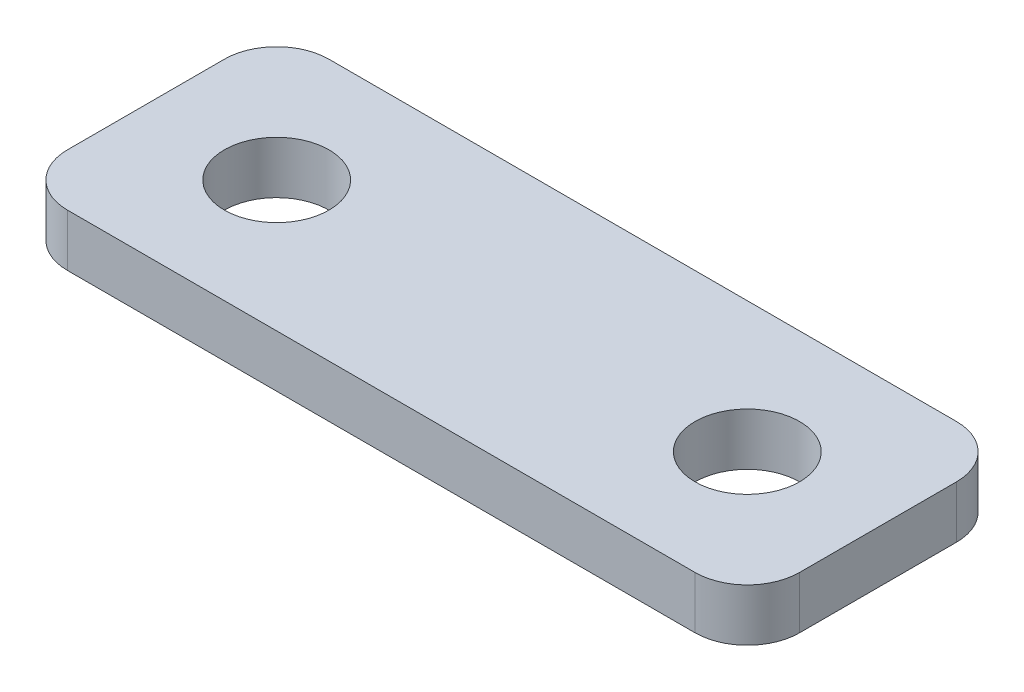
ISO-10303-21;
HEADER;
FILE_DESCRIPTION(('STEP AP214'),'2;1');
FILE_NAME('part.step','',(''),(''),'','','');
FILE_SCHEMA(('AUTOMOTIVE_DESIGN { 1 0 10303 214 1 1 1 1 }'));
ENDSEC;
DATA;
#1=APPLICATION_CONTEXT('core data for automotive mechanical design processes');
#2=APPLICATION_PROTOCOL_DEFINITION('international standard','automotive_design',2000,#1);
#3=PRODUCT_CONTEXT('',#1,'mechanical');
#4=PRODUCT('Part','Part','',(#3));
#5=PRODUCT_RELATED_PRODUCT_CATEGORY('part','',(#4));
#6=PRODUCT_DEFINITION_FORMATION('','',#4);
#7=PRODUCT_DEFINITION_CONTEXT('part definition',#1,'design');
#8=PRODUCT_DEFINITION('design','',#6,#7);
#9=PRODUCT_DEFINITION_SHAPE('','',#8);
#10=(LENGTH_UNIT() NAMED_UNIT(*) SI_UNIT(.MILLI.,.METRE.));
#11=(NAMED_UNIT(*) PLANE_ANGLE_UNIT() SI_UNIT($,.RADIAN.));
#12=(NAMED_UNIT(*) SI_UNIT($,.STERADIAN.) SOLID_ANGLE_UNIT());
#13=UNCERTAINTY_MEASURE_WITH_UNIT(LENGTH_MEASURE(1.E-05),#10,'distance_accuracy_value','');
#14=(GEOMETRIC_REPRESENTATION_CONTEXT(3) GLOBAL_UNCERTAINTY_ASSIGNED_CONTEXT((#13)) GLOBAL_UNIT_ASSIGNED_CONTEXT((#10,
#11,#12)) REPRESENTATION_CONTEXT('',''));
#15=CARTESIAN_POINT('',(0.,0.,0.));
#16=DIRECTION('',(0.,0.,1.));
#17=DIRECTION('',(1.,0.,0.));
#18=AXIS2_PLACEMENT_3D('',#15,#16,#17);
#19=CARTESIAN_POINT('',(-19.05,3.175,4.7625));
#20=DIRECTION('',(0.,1.,0.));
#21=DIRECTION('',(0.,0.,1.));
#22=AXIS2_PLACEMENT_3D('',#19,#20,#21);
#23=PLANE('',#22);
#24=CARTESIAN_POINT('',(-14.2875,3.175,0.));
#25=DIRECTION('',(0.,1.,0.));
#26=DIRECTION('',(0.,0.,1.));
#27=AXIS2_PLACEMENT_3D('',#24,#25,#26);
#28=CIRCLE('',#27,3.175);
#29=CARTESIAN_POINT('',(-14.2875,3.175,3.175));
#30=VERTEX_POINT('',#29);
#31=EDGE_CURVE('E152',#30,#30,#28,.T.);
#32=ORIENTED_EDGE('',*,*,#31,.F.);
#33=EDGE_LOOP('',(#32));
#34=FACE_BOUND('',#33,.T.);
#35=CARTESIAN_POINT('',(-19.05,3.175,4.7625));
#36=DIRECTION('',(0.,1.,0.));
#37=DIRECTION('',(0.,0.,1.));
#38=AXIS2_PLACEMENT_3D('',#35,#36,#37);
#39=CIRCLE('',#38,3.175);
#40=CARTESIAN_POINT('',(-22.225,3.175,4.76249999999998));
#41=VERTEX_POINT('',#40);
#42=CARTESIAN_POINT('',(-19.05,3.175,7.9375));
#43=VERTEX_POINT('',#42);
#44=EDGE_CURVE('E170',#41,#43,#39,.T.);
#45=ORIENTED_EDGE('',*,*,#44,.T.);
#46=DIRECTION('',(1.,0.,0.));
#47=VECTOR('',#46,1.);
#48=CARTESIAN_POINT('',(-19.05,3.175,7.9375));
#49=LINE('',#48,#47);
#50=CARTESIAN_POINT('',(19.05,3.175,7.9375));
#51=VERTEX_POINT('',#50);
#52=EDGE_CURVE('E106',#43,#51,#49,.T.);
#53=ORIENTED_EDGE('',*,*,#52,.T.);
#54=CARTESIAN_POINT('',(19.05,3.175,4.7625));
#55=DIRECTION('',(0.,1.,0.));
#56=DIRECTION('',(0.,0.,1.));
#57=AXIS2_PLACEMENT_3D('',#54,#55,#56);
#58=CIRCLE('',#57,3.175);
#59=CARTESIAN_POINT('',(22.225,3.175,4.76249999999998));
#60=VERTEX_POINT('',#59);
#61=EDGE_CURVE('E191',#51,#60,#58,.T.);
#62=ORIENTED_EDGE('',*,*,#61,.T.);
#63=DIRECTION('',(0.,0.,-1.));
#64=VECTOR('',#63,1.);
#65=CARTESIAN_POINT('',(22.225,3.175,-4.76249999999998));
#66=LINE('',#65,#64);
#67=CARTESIAN_POINT('',(22.225,3.175,-4.76249999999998));
#68=VERTEX_POINT('',#67);
#69=EDGE_CURVE('E205',#60,#68,#66,.T.);
#70=ORIENTED_EDGE('',*,*,#69,.T.);
#71=CARTESIAN_POINT('',(19.05,3.175,-4.7625));
#72=DIRECTION('',(0.,1.,0.));
#73=DIRECTION('',(0.,0.,-1.));
#74=AXIS2_PLACEMENT_3D('',#71,#72,#73);
#75=CIRCLE('',#74,3.175);
#76=CARTESIAN_POINT('',(19.05,3.175,-7.9375));
#77=VERTEX_POINT('',#76);
#78=EDGE_CURVE('E125',#68,#77,#75,.T.);
#79=ORIENTED_EDGE('',*,*,#78,.T.);
#80=DIRECTION('',(-1.,0.,0.));
#81=VECTOR('',#80,1.);
#82=CARTESIAN_POINT('',(-19.05,3.175,-7.9375));
#83=LINE('',#82,#81);
#84=CARTESIAN_POINT('',(-19.05,3.175,-7.9375));
#85=VERTEX_POINT('',#84);
#86=EDGE_CURVE('E119',#77,#85,#83,.T.);
#87=ORIENTED_EDGE('',*,*,#86,.T.);
#88=CARTESIAN_POINT('',(-19.05,3.175,-4.7625));
#89=DIRECTION('',(0.,1.,0.));
#90=DIRECTION('',(0.,0.,1.));
#91=AXIS2_PLACEMENT_3D('',#88,#89,#90);
#92=CIRCLE('',#91,3.175);
#93=CARTESIAN_POINT('',(-22.225,3.175,-4.76249999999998));
#94=VERTEX_POINT('',#93);
#95=EDGE_CURVE('E123',#85,#94,#92,.T.);
#96=ORIENTED_EDGE('',*,*,#95,.T.);
#97=DIRECTION('',(0.,0.,1.));
#98=VECTOR('',#97,1.);
#99=CARTESIAN_POINT('',(-22.225,3.175,-4.76249999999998));
#100=LINE('',#99,#98);
#101=EDGE_CURVE('E63',#94,#41,#100,.T.);
#102=ORIENTED_EDGE('',*,*,#101,.T.);
#103=EDGE_LOOP('',(#45,#53,#62,#70,#79,#87,#96,#102));
#104=FACE_BOUND('',#103,.T.);
#105=CARTESIAN_POINT('',(14.2875,3.175,0.));
#106=DIRECTION('',(0.,1.,0.));
#107=DIRECTION('',(0.,0.,1.));
#108=AXIS2_PLACEMENT_3D('',#105,#106,#107);
#109=CIRCLE('',#108,3.175);
#110=CARTESIAN_POINT('',(14.2875,3.175,3.175));
#111=VERTEX_POINT('',#110);
#112=EDGE_CURVE('E219',#111,#111,#109,.T.);
#113=ORIENTED_EDGE('',*,*,#112,.F.);
#114=EDGE_LOOP('',(#113));
#115=FACE_BOUND('',#114,.T.);
#116=ADVANCED_FACE('F45',(#34,#104,#115),#23,.T.);
#117=CARTESIAN_POINT('',(-19.05,0.,4.7625));
#118=DIRECTION('',(0.,1.,0.));
#119=DIRECTION('',(0.,0.,1.));
#120=AXIS2_PLACEMENT_3D('',#117,#118,#119);
#121=PLANE('',#120);
#122=CARTESIAN_POINT('',(-19.05,0.,4.7625));
#123=DIRECTION('',(0.,1.,0.));
#124=DIRECTION('',(0.,0.,1.));
#125=AXIS2_PLACEMENT_3D('',#122,#123,#124);
#126=CIRCLE('',#125,3.175);
#127=CARTESIAN_POINT('',(-22.225,0.,4.76249999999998));
#128=VERTEX_POINT('',#127);
#129=CARTESIAN_POINT('',(-19.05,0.,7.9375));
#130=VERTEX_POINT('',#129);
#131=EDGE_CURVE('E147',#128,#130,#126,.T.);
#132=ORIENTED_EDGE('',*,*,#131,.F.);
#133=DIRECTION('',(0.,0.,1.));
#134=VECTOR('',#133,1.);
#135=CARTESIAN_POINT('',(-22.225,0.,-4.76249999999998));
#136=LINE('',#135,#134);
#137=CARTESIAN_POINT('',(-22.225,0.,-4.76249999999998));
#138=VERTEX_POINT('',#137);
#139=EDGE_CURVE('E98',#138,#128,#136,.T.);
#140=ORIENTED_EDGE('',*,*,#139,.F.);
#141=CARTESIAN_POINT('',(-19.05,0.,-4.7625));
#142=DIRECTION('',(0.,1.,0.));
#143=DIRECTION('',(0.,0.,1.));
#144=AXIS2_PLACEMENT_3D('',#141,#142,#143);
#145=CIRCLE('',#144,3.175);
#146=CARTESIAN_POINT('',(-19.05,0.,-7.9375));
#147=VERTEX_POINT('',#146);
#148=EDGE_CURVE('E92',#147,#138,#145,.T.);
#149=ORIENTED_EDGE('',*,*,#148,.F.);
#150=DIRECTION('',(-1.,0.,0.));
#151=VECTOR('',#150,1.);
#152=CARTESIAN_POINT('',(-19.05,0.,-7.9375));
#153=LINE('',#152,#151);
#154=CARTESIAN_POINT('',(19.05,0.,-7.9375));
#155=VERTEX_POINT('',#154);
#156=EDGE_CURVE('E134',#155,#147,#153,.T.);
#157=ORIENTED_EDGE('',*,*,#156,.F.);
#158=CARTESIAN_POINT('',(19.05,0.,-4.7625));
#159=DIRECTION('',(0.,1.,0.));
#160=DIRECTION('',(0.,0.,-1.));
#161=AXIS2_PLACEMENT_3D('',#158,#159,#160);
#162=CIRCLE('',#161,3.175);
#163=CARTESIAN_POINT('',(22.225,0.,-4.76249999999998));
#164=VERTEX_POINT('',#163);
#165=EDGE_CURVE('E161',#164,#155,#162,.T.);
#166=ORIENTED_EDGE('',*,*,#165,.F.);
#167=DIRECTION('',(0.,0.,-1.));
#168=VECTOR('',#167,1.);
#169=CARTESIAN_POINT('',(22.225,0.,-4.76249999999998));
#170=LINE('',#169,#168);
#171=CARTESIAN_POINT('',(22.225,0.,4.76249999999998));
#172=VERTEX_POINT('',#171);
#173=EDGE_CURVE('E158',#172,#164,#170,.T.);
#174=ORIENTED_EDGE('',*,*,#173,.F.);
#175=CARTESIAN_POINT('',(19.05,0.,4.7625));
#176=DIRECTION('',(0.,1.,0.));
#177=DIRECTION('',(0.,0.,1.));
#178=AXIS2_PLACEMENT_3D('',#175,#176,#177);
#179=CIRCLE('',#178,3.175);
#180=CARTESIAN_POINT('',(19.05,0.,7.9375));
#181=VERTEX_POINT('',#180);
#182=EDGE_CURVE('E155',#181,#172,#179,.T.);
#183=ORIENTED_EDGE('',*,*,#182,.F.);
#184=DIRECTION('',(1.,0.,0.));
#185=VECTOR('',#184,1.);
#186=CARTESIAN_POINT('',(-19.05,0.,7.9375));
#187=LINE('',#186,#185);
#188=EDGE_CURVE('E151',#130,#181,#187,.T.);
#189=ORIENTED_EDGE('',*,*,#188,.F.);
#190=EDGE_LOOP('',(#132,#140,#149,#157,#166,#174,#183,#189));
#191=FACE_BOUND('',#190,.T.);
#192=CARTESIAN_POINT('',(-14.2875,0.,0.));
#193=DIRECTION('',(0.,1.,0.));
#194=DIRECTION('',(0.,0.,1.));
#195=AXIS2_PLACEMENT_3D('',#192,#193,#194);
#196=CIRCLE('',#195,3.175);
#197=CARTESIAN_POINT('',(-14.2875,0.,3.175));
#198=VERTEX_POINT('',#197);
#199=EDGE_CURVE('E215',#198,#198,#196,.T.);
#200=ORIENTED_EDGE('',*,*,#199,.T.);
#201=EDGE_LOOP('',(#200));
#202=FACE_BOUND('',#201,.T.);
#203=CARTESIAN_POINT('',(14.2875,0.,0.));
#204=DIRECTION('',(0.,1.,0.));
#205=DIRECTION('',(0.,0.,1.));
#206=AXIS2_PLACEMENT_3D('',#203,#204,#205);
#207=CIRCLE('',#206,3.175);
#208=CARTESIAN_POINT('',(14.2875,0.,3.175));
#209=VERTEX_POINT('',#208);
#210=EDGE_CURVE('E223',#209,#209,#207,.T.);
#211=ORIENTED_EDGE('',*,*,#210,.T.);
#212=EDGE_LOOP('',(#211));
#213=FACE_BOUND('',#212,.T.);
#214=ADVANCED_FACE('F195',(#191,#202,#213),#121,.F.);
#215=CARTESIAN_POINT('',(-19.05,3.175,4.7625));
#216=DIRECTION('',(0.,-1.,0.));
#217=DIRECTION('',(0.,0.,-1.));
#218=AXIS2_PLACEMENT_3D('',#215,#216,#217);
#219=CYLINDRICAL_SURFACE('',#218,3.175);
#220=ORIENTED_EDGE('',*,*,#131,.T.);
#221=DIRECTION('',(0.,-1.,0.));
#222=VECTOR('',#221,1.);
#223=CARTESIAN_POINT('',(-19.05,3.175,7.9375));
#224=LINE('',#223,#222);
#225=EDGE_CURVE('E11',#43,#130,#224,.T.);
#226=ORIENTED_EDGE('',*,*,#225,.F.);
#227=ORIENTED_EDGE('',*,*,#44,.F.);
#228=DIRECTION('',(0.,-1.,0.));
#229=VECTOR('',#228,1.);
#230=CARTESIAN_POINT('',(-22.225,3.175,4.76249999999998));
#231=LINE('',#230,#229);
#232=EDGE_CURVE('E143',#41,#128,#231,.T.);
#233=ORIENTED_EDGE('',*,*,#232,.T.);
#234=EDGE_LOOP('',(#220,#226,#227,#233));
#235=FACE_BOUND('',#234,.T.);
#236=ADVANCED_FACE('F47',(#235),#219,.T.);
#237=CARTESIAN_POINT('',(-19.05,3.175,7.9375));
#238=DIRECTION('',(0.,0.,-1.));
#239=DIRECTION('',(-1.,0.,0.));
#240=AXIS2_PLACEMENT_3D('',#237,#238,#239);
#241=PLANE('',#240);
#242=ORIENTED_EDGE('',*,*,#188,.T.);
#243=DIRECTION('',(0.,-1.,0.));
#244=VECTOR('',#243,1.);
#245=CARTESIAN_POINT('',(19.05,3.175,7.9375));
#246=LINE('',#245,#244);
#247=EDGE_CURVE('E55',#51,#181,#246,.T.);
#248=ORIENTED_EDGE('',*,*,#247,.F.);
#249=ORIENTED_EDGE('',*,*,#52,.F.);
#250=ORIENTED_EDGE('',*,*,#225,.T.);
#251=EDGE_LOOP('',(#242,#248,#249,#250));
#252=FACE_BOUND('',#251,.T.);
#253=ADVANCED_FACE('F257',(#252),#241,.F.);
#254=CARTESIAN_POINT('',(19.05,3.175,4.7625));
#255=DIRECTION('',(0.,-1.,0.));
#256=DIRECTION('',(0.,0.,-1.));
#257=AXIS2_PLACEMENT_3D('',#254,#255,#256);
#258=CYLINDRICAL_SURFACE('',#257,3.175);
#259=ORIENTED_EDGE('',*,*,#182,.T.);
#260=DIRECTION('',(0.,-1.,0.));
#261=VECTOR('',#260,1.);
#262=CARTESIAN_POINT('',(22.225,3.175,4.76249999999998));
#263=LINE('',#262,#261);
#264=EDGE_CURVE('E181',#60,#172,#263,.T.);
#265=ORIENTED_EDGE('',*,*,#264,.F.);
#266=ORIENTED_EDGE('',*,*,#61,.F.);
#267=ORIENTED_EDGE('',*,*,#247,.T.);
#268=EDGE_LOOP('',(#259,#265,#266,#267));
#269=FACE_BOUND('',#268,.T.);
#270=ADVANCED_FACE('F189',(#269),#258,.T.);
#271=CARTESIAN_POINT('',(22.225,3.175,-4.76249999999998));
#272=DIRECTION('',(-1.,0.,0.));
#273=DIRECTION('',(0.,0.,1.));
#274=AXIS2_PLACEMENT_3D('',#271,#272,#273);
#275=PLANE('',#274);
#276=ORIENTED_EDGE('',*,*,#173,.T.);
#277=DIRECTION('',(0.,-1.,0.));
#278=VECTOR('',#277,1.);
#279=CARTESIAN_POINT('',(22.225,3.175,-4.76249999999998));
#280=LINE('',#279,#278);
#281=EDGE_CURVE('E177',#68,#164,#280,.T.);
#282=ORIENTED_EDGE('',*,*,#281,.F.);
#283=ORIENTED_EDGE('',*,*,#69,.F.);
#284=ORIENTED_EDGE('',*,*,#264,.T.);
#285=EDGE_LOOP('',(#276,#282,#283,#284));
#286=FACE_BOUND('',#285,.T.);
#287=ADVANCED_FACE('F200',(#286),#275,.F.);
#288=CARTESIAN_POINT('',(19.05,3.175,-4.7625));
#289=DIRECTION('',(0.,-1.,0.));
#290=DIRECTION('',(0.,0.,-1.));
#291=AXIS2_PLACEMENT_3D('',#288,#289,#290);
#292=CYLINDRICAL_SURFACE('',#291,3.175);
#293=ORIENTED_EDGE('',*,*,#165,.T.);
#294=DIRECTION('',(0.,-1.,0.));
#295=VECTOR('',#294,1.);
#296=CARTESIAN_POINT('',(19.05,3.175,-7.9375));
#297=LINE('',#296,#295);
#298=EDGE_CURVE('E136',#77,#155,#297,.T.);
#299=ORIENTED_EDGE('',*,*,#298,.F.);
#300=ORIENTED_EDGE('',*,*,#78,.F.);
#301=ORIENTED_EDGE('',*,*,#281,.T.);
#302=EDGE_LOOP('',(#293,#299,#300,#301));
#303=FACE_BOUND('',#302,.T.);
#304=ADVANCED_FACE('F203',(#303),#292,.T.);
#305=CARTESIAN_POINT('',(-19.05,3.175,-7.9375));
#306=DIRECTION('',(0.,0.,1.));
#307=DIRECTION('',(1.,0.,0.));
#308=AXIS2_PLACEMENT_3D('',#305,#306,#307);
#309=PLANE('',#308);
#310=ORIENTED_EDGE('',*,*,#156,.T.);
#311=DIRECTION('',(0.,-1.,0.));
#312=VECTOR('',#311,1.);
#313=CARTESIAN_POINT('',(-19.05,3.175,-7.9375));
#314=LINE('',#313,#312);
#315=EDGE_CURVE('E131',#85,#147,#314,.T.);
#316=ORIENTED_EDGE('',*,*,#315,.F.);
#317=ORIENTED_EDGE('',*,*,#86,.F.);
#318=ORIENTED_EDGE('',*,*,#298,.T.);
#319=EDGE_LOOP('',(#310,#316,#317,#318));
#320=FACE_BOUND('',#319,.T.);
#321=ADVANCED_FACE('F132',(#320),#309,.F.);
#322=CARTESIAN_POINT('',(-19.05,3.175,-4.7625));
#323=DIRECTION('',(0.,-1.,0.));
#324=DIRECTION('',(0.,0.,-1.));
#325=AXIS2_PLACEMENT_3D('',#322,#323,#324);
#326=CYLINDRICAL_SURFACE('',#325,3.175);
#327=ORIENTED_EDGE('',*,*,#148,.T.);
#328=DIRECTION('',(0.,-1.,0.));
#329=VECTOR('',#328,1.);
#330=CARTESIAN_POINT('',(-22.225,3.175,-4.76249999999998));
#331=LINE('',#330,#329);
#332=EDGE_CURVE('E137',#94,#138,#331,.T.);
#333=ORIENTED_EDGE('',*,*,#332,.F.);
#334=ORIENTED_EDGE('',*,*,#95,.F.);
#335=ORIENTED_EDGE('',*,*,#315,.T.);
#336=EDGE_LOOP('',(#327,#333,#334,#335));
#337=FACE_BOUND('',#336,.T.);
#338=ADVANCED_FACE('F139',(#337),#326,.T.);
#339=CARTESIAN_POINT('',(-22.225,3.175,-4.76249999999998));
#340=DIRECTION('',(1.,0.,0.));
#341=DIRECTION('',(0.,0.,-1.));
#342=AXIS2_PLACEMENT_3D('',#339,#340,#341);
#343=PLANE('',#342);
#344=ORIENTED_EDGE('',*,*,#139,.T.);
#345=ORIENTED_EDGE('',*,*,#232,.F.);
#346=ORIENTED_EDGE('',*,*,#101,.F.);
#347=ORIENTED_EDGE('',*,*,#332,.T.);
#348=EDGE_LOOP('',(#344,#345,#346,#347));
#349=FACE_BOUND('',#348,.T.);
#350=ADVANCED_FACE('F245',(#349),#343,.F.);
#351=CARTESIAN_POINT('',(-14.2875,3.175,0.));
#352=DIRECTION('',(0.,-1.,0.));
#353=DIRECTION('',(0.,0.,-1.));
#354=AXIS2_PLACEMENT_3D('',#351,#352,#353);
#355=CYLINDRICAL_SURFACE('',#354,3.175);
#356=ORIENTED_EDGE('',*,*,#31,.T.);
#357=EDGE_LOOP('',(#356));
#358=FACE_BOUND('',#357,.T.);
#359=ORIENTED_EDGE('',*,*,#199,.F.);
#360=EDGE_LOOP('',(#359));
#361=FACE_BOUND('',#360,.T.);
#362=ADVANCED_FACE('F242',(#358,#361),#355,.F.);
#363=CARTESIAN_POINT('',(14.2875,3.175,0.));
#364=DIRECTION('',(0.,-1.,0.));
#365=DIRECTION('',(0.,0.,-1.));
#366=AXIS2_PLACEMENT_3D('',#363,#364,#365);
#367=CYLINDRICAL_SURFACE('',#366,3.175);
#368=ORIENTED_EDGE('',*,*,#112,.T.);
#369=EDGE_LOOP('',(#368));
#370=FACE_BOUND('',#369,.T.);
#371=ORIENTED_EDGE('',*,*,#210,.F.);
#372=EDGE_LOOP('',(#371));
#373=FACE_BOUND('',#372,.T.);
#374=ADVANCED_FACE('F231',(#370,#373),#367,.F.);
#375=CLOSED_SHELL('',(#116,#214,#236,#253,#270,#287,#304,#321,#338,#350,#362,#374));
#376=MANIFOLD_SOLID_BREP('B2',#375);
#377=ADVANCED_BREP_SHAPE_REPRESENTATION('',(#18,#376),#14);
#378=SHAPE_DEFINITION_REPRESENTATION(#9,#377);
ENDSEC;
END-ISO-10303-21;
